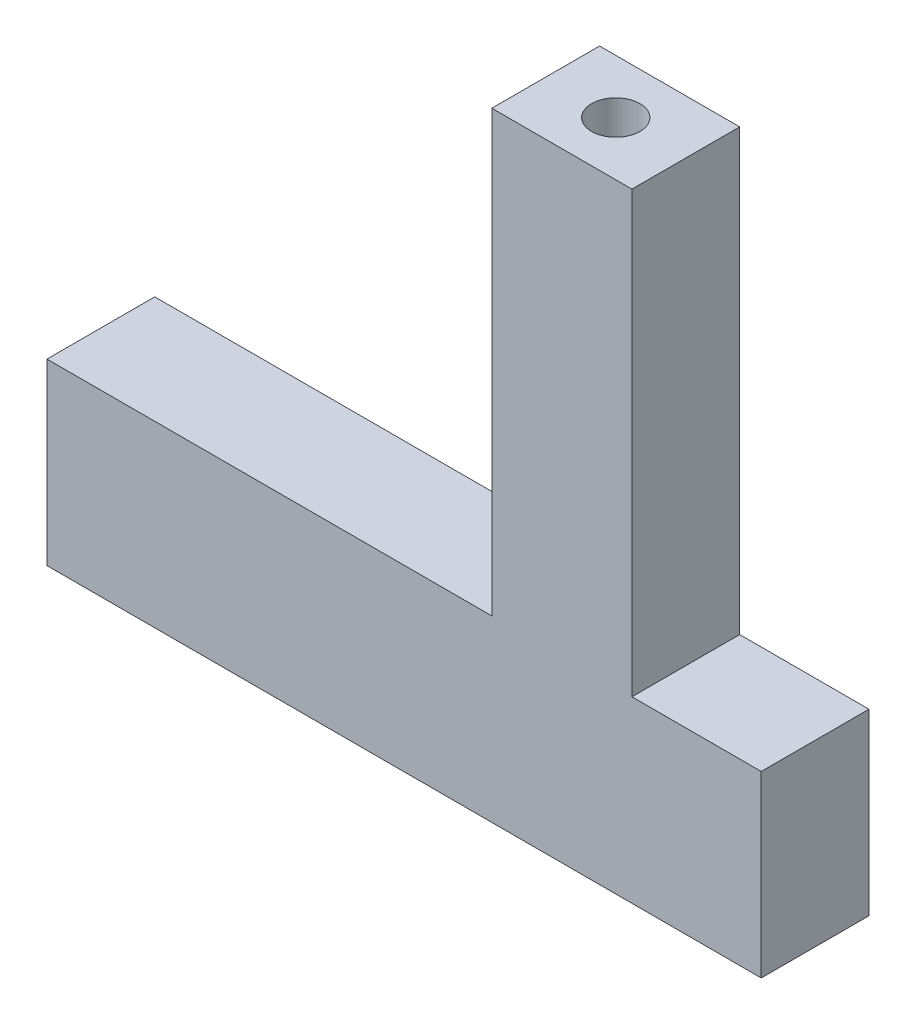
from build123d import *

# Parameters (mm, degrees)
EXTRUDE1_DEPTH                  = 6.35
F_4_40_TAPPED_HOLE1_D           = 2.2606
F_4_40_TAPPED_HOLE1_DEPTH       = 14.732
F_4_40_TAPPED_HOLE1_CBORE_D     = 2.8448
F_4_40_TAPPED_HOLE1_CBORE_DEPTH = 12.7
F_4_40_TAPPED_HOLE1_TIP         = 0.679152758


with BuildPart() as part:
    # Sketch1 → Extrude1 (new body)
    with BuildSketch(Plane.XY):
        Polygon((-42.0878, 0), (0, 0), (0, 10.541), (-7.62, 10.541), (-7.62, 36.449), (-15.875, 36.449), (-15.875, 10.541), (-42.0878, 10.541), align=None)
    extrude(amount=EXTRUDE1_DEPTH)

    # 4-40 Tapped Hole1
    with Locations(Plane(origin=(-11.7475, 36.449, 3.175), x_dir=(0, 0, 1), z_dir=(0, 1, 0))):
        with Locations((0, 0)):
            CounterBoreHole(F_4_40_TAPPED_HOLE1_D / 2, F_4_40_TAPPED_HOLE1_CBORE_D / 2, F_4_40_TAPPED_HOLE1_CBORE_DEPTH, depth=F_4_40_TAPPED_HOLE1_DEPTH)
            with Locations((0, 0, -(F_4_40_TAPPED_HOLE1_DEPTH + F_4_40_TAPPED_HOLE1_TIP / 2))):  # 118° drill point
                Cone(0, F_4_40_TAPPED_HOLE1_D / 2, F_4_40_TAPPED_HOLE1_TIP, mode=Mode.SUBTRACT)


solid = part.part
